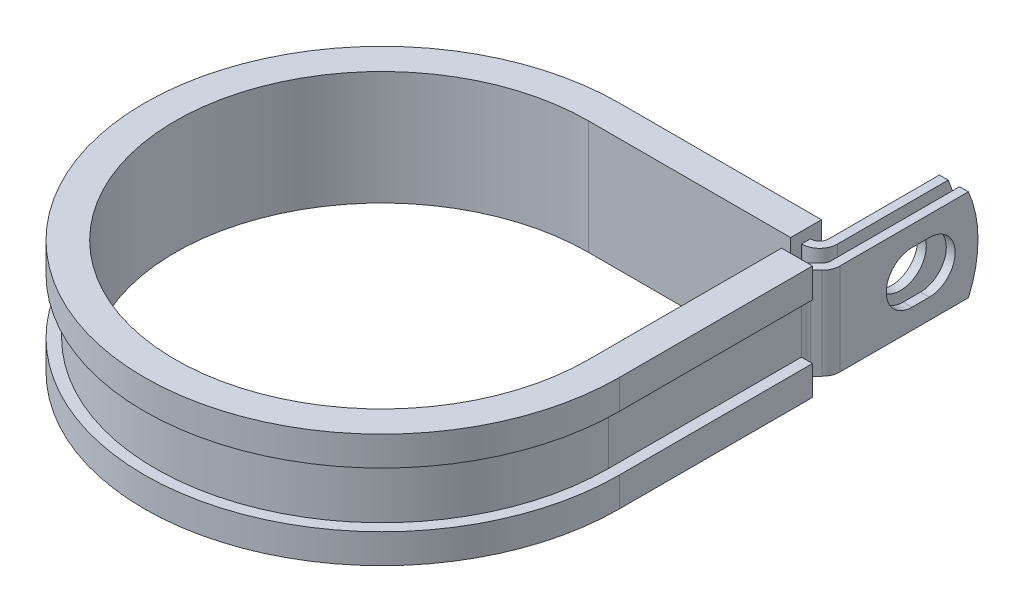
ISO-10303-21;
HEADER;
FILE_DESCRIPTION(('STEP AP214'),'2;1');
FILE_NAME('part.step','',(''),(''),'','','');
FILE_SCHEMA(('AUTOMOTIVE_DESIGN { 1 0 10303 214 1 1 1 1 }'));
ENDSEC;
DATA;
#1=APPLICATION_CONTEXT('core data for automotive mechanical design processes');
#2=APPLICATION_PROTOCOL_DEFINITION('international standard','automotive_design',2000,#1);
#3=PRODUCT_CONTEXT('',#1,'mechanical');
#4=PRODUCT('Part','Part','',(#3));
#5=PRODUCT_RELATED_PRODUCT_CATEGORY('part','',(#4));
#6=PRODUCT_DEFINITION_FORMATION('','',#4);
#7=PRODUCT_DEFINITION_CONTEXT('part definition',#1,'design');
#8=PRODUCT_DEFINITION('design','',#6,#7);
#9=PRODUCT_DEFINITION_SHAPE('','',#8);
#10=(LENGTH_UNIT() NAMED_UNIT(*) SI_UNIT(.MILLI.,.METRE.));
#11=(NAMED_UNIT(*) PLANE_ANGLE_UNIT() SI_UNIT($,.RADIAN.));
#12=(NAMED_UNIT(*) SI_UNIT($,.STERADIAN.) SOLID_ANGLE_UNIT());
#13=UNCERTAINTY_MEASURE_WITH_UNIT(LENGTH_MEASURE(1.E-05),#10,'distance_accuracy_value','');
#14=(GEOMETRIC_REPRESENTATION_CONTEXT(3) GLOBAL_UNCERTAINTY_ASSIGNED_CONTEXT((#13)) GLOBAL_UNIT_ASSIGNED_CONTEXT((#10,
#11,#12)) REPRESENTATION_CONTEXT('',''));
#15=CARTESIAN_POINT('',(0.,0.,0.));
#16=DIRECTION('',(0.,0.,1.));
#17=DIRECTION('',(1.,0.,0.));
#18=AXIS2_PLACEMENT_3D('',#15,#16,#17);
#19=CARTESIAN_POINT('',(30.7772698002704,-6.35,-30.099));
#20=DIRECTION('',(0.,1.,0.));
#21=DIRECTION('',(1.,0.,0.));
#22=AXIS2_PLACEMENT_3D('',#19,#20,#21);
#23=PLANE('',#22);
#24=DIRECTION('',(0.,0.,-1.));
#25=VECTOR('',#24,1.);
#26=CARTESIAN_POINT('',(27.9324698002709,-6.35,-30.099));
#27=LINE('',#26,#25);
#28=CARTESIAN_POINT('',(27.9324698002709,-6.35,-30.099));
#29=VERTEX_POINT('',#28);
#30=CARTESIAN_POINT('',(27.9324698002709,-6.35,-31.3182));
#31=VERTEX_POINT('',#30);
#32=EDGE_CURVE('E505',#29,#31,#27,.T.);
#33=ORIENTED_EDGE('',*,*,#32,.T.);
#34=DIRECTION('',(1.,0.,0.));
#35=VECTOR('',#34,1.);
#36=CARTESIAN_POINT('',(0.,-6.35,-31.3182));
#37=LINE('',#36,#35);
#38=CARTESIAN_POINT('',(27.9832698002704,-6.35,-31.3182));
#39=VERTEX_POINT('',#38);
#40=EDGE_CURVE('E392',#39,#31,#37,.F.);
#41=ORIENTED_EDGE('',*,*,#40,.F.);
#42=CARTESIAN_POINT('',(27.9832698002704,-6.35,-32.5374));
#43=DIRECTION('',(0.,1.,0.));
#44=DIRECTION('',(1.,0.,0.));
#45=AXIS2_PLACEMENT_3D('',#42,#43,#44);
#46=CIRCLE('',#45,1.2192);
#47=CARTESIAN_POINT('',(29.2024698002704,-6.35,-32.5374));
#48=VERTEX_POINT('',#47);
#49=EDGE_CURVE('E390',#48,#39,#46,.F.);
#50=ORIENTED_EDGE('',*,*,#49,.F.);
#51=DIRECTION('',(0.,0.,1.));
#52=VECTOR('',#51,1.);
#53=CARTESIAN_POINT('',(29.2024698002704,-6.35,-49.1998));
#54=LINE('',#53,#52);
#55=CARTESIAN_POINT('',(29.2024698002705,-6.35,-47.8744778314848));
#56=VERTEX_POINT('',#55);
#57=EDGE_CURVE('E388',#56,#48,#54,.T.);
#58=ORIENTED_EDGE('',*,*,#57,.F.);
#59=DIRECTION('',(-1.,0.,0.));
#60=VECTOR('',#59,1.);
#61=CARTESIAN_POINT('',(33.2156698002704,-6.35,-47.8744778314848));
#62=LINE('',#61,#60);
#63=CARTESIAN_POINT('',(30.4216698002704,-6.35,-47.8744778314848));
#64=VERTEX_POINT('',#63);
#65=EDGE_CURVE('E11',#64,#56,#62,.T.);
#66=ORIENTED_EDGE('',*,*,#65,.F.);
#67=DIRECTION('',(0.,0.,1.));
#68=VECTOR('',#67,1.);
#69=CARTESIAN_POINT('',(30.4216698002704,-6.35,-49.1998));
#70=LINE('',#69,#68);
#71=CARTESIAN_POINT('',(30.4216698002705,-6.35,-32.5374));
#72=VERTEX_POINT('',#71);
#73=EDGE_CURVE('E386',#64,#72,#70,.T.);
#74=ORIENTED_EDGE('',*,*,#73,.T.);
#75=CARTESIAN_POINT('',(27.9832698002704,-6.35,-32.5374));
#76=DIRECTION('',(0.,-1.,0.));
#77=DIRECTION('',(0.,0.,1.));
#78=AXIS2_PLACEMENT_3D('',#75,#76,#77);
#79=CIRCLE('',#78,2.4384);
#80=CARTESIAN_POINT('',(27.9832698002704,-6.35,-30.099));
#81=VERTEX_POINT('',#80);
#82=EDGE_CURVE('E383',#72,#81,#79,.T.);
#83=ORIENTED_EDGE('',*,*,#82,.T.);
#84=DIRECTION('',(-1.,0.,0.));
#85=VECTOR('',#84,1.);
#86=CARTESIAN_POINT('',(0.,-6.35,-30.099));
#87=LINE('',#86,#85);
#88=EDGE_CURVE('E380',#81,#29,#87,.T.);
#89=ORIENTED_EDGE('',*,*,#88,.T.);
#90=EDGE_LOOP('',(#33,#41,#50,#58,#66,#74,#83,#89));
#91=FACE_BOUND('',#90,.T.);
#92=ADVANCED_FACE('F36',(#91),#23,.F.);
#93=CARTESIAN_POINT('',(30.7772698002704,6.35,-30.099));
#94=DIRECTION('',(0.,1.,0.));
#95=DIRECTION('',(1.,0.,0.));
#96=AXIS2_PLACEMENT_3D('',#93,#94,#95);
#97=PLANE('',#96);
#98=DIRECTION('',(1.,0.,0.));
#99=VECTOR('',#98,1.);
#100=CARTESIAN_POINT('',(0.,6.35,-31.3182));
#101=LINE('',#100,#99);
#102=CARTESIAN_POINT('',(27.9832698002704,6.35,-31.3182));
#103=VERTEX_POINT('',#102);
#104=CARTESIAN_POINT('',(27.9324698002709,6.35,-31.3182));
#105=VERTEX_POINT('',#104);
#106=EDGE_CURVE('E350',#103,#105,#101,.F.);
#107=ORIENTED_EDGE('',*,*,#106,.T.);
#108=DIRECTION('',(0.,0.,1.));
#109=VECTOR('',#108,1.);
#110=CARTESIAN_POINT('',(27.9324698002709,6.35,-31.3182));
#111=LINE('',#110,#109);
#112=CARTESIAN_POINT('',(27.9324698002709,6.35,-30.099));
#113=VERTEX_POINT('',#112);
#114=EDGE_CURVE('E499',#105,#113,#111,.T.);
#115=ORIENTED_EDGE('',*,*,#114,.T.);
#116=DIRECTION('',(-1.,0.,0.));
#117=VECTOR('',#116,1.);
#118=CARTESIAN_POINT('',(0.,6.35,-30.099));
#119=LINE('',#118,#117);
#120=CARTESIAN_POINT('',(27.9832698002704,6.35,-30.099));
#121=VERTEX_POINT('',#120);
#122=EDGE_CURVE('E607',#121,#113,#119,.T.);
#123=ORIENTED_EDGE('',*,*,#122,.F.);
#124=CARTESIAN_POINT('',(27.9832698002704,6.35,-32.5374));
#125=DIRECTION('',(0.,-1.,0.));
#126=DIRECTION('',(0.,0.,1.));
#127=AXIS2_PLACEMENT_3D('',#124,#125,#126);
#128=CIRCLE('',#127,2.4384);
#129=CARTESIAN_POINT('',(30.4216698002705,6.35,-32.5374));
#130=VERTEX_POINT('',#129);
#131=EDGE_CURVE('E352',#130,#121,#128,.T.);
#132=ORIENTED_EDGE('',*,*,#131,.F.);
#133=DIRECTION('',(0.,0.,1.));
#134=VECTOR('',#133,1.);
#135=CARTESIAN_POINT('',(30.4216698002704,6.35,-49.1998));
#136=LINE('',#135,#134);
#137=CARTESIAN_POINT('',(30.4216698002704,6.35,-47.8744778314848));
#138=VERTEX_POINT('',#137);
#139=EDGE_CURVE('E343',#138,#130,#136,.T.);
#140=ORIENTED_EDGE('',*,*,#139,.F.);
#141=DIRECTION('',(-1.,0.,0.));
#142=VECTOR('',#141,1.);
#143=CARTESIAN_POINT('',(33.2156698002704,6.35,-47.8744778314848));
#144=LINE('',#143,#142);
#145=CARTESIAN_POINT('',(29.2024698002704,6.35,-47.8744778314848));
#146=VERTEX_POINT('',#145);
#147=EDGE_CURVE('E44',#138,#146,#144,.T.);
#148=ORIENTED_EDGE('',*,*,#147,.T.);
#149=DIRECTION('',(0.,0.,1.));
#150=VECTOR('',#149,1.);
#151=CARTESIAN_POINT('',(29.2024698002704,6.35,-49.1998));
#152=LINE('',#151,#150);
#153=CARTESIAN_POINT('',(29.2024698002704,6.35,-32.5374));
#154=VERTEX_POINT('',#153);
#155=EDGE_CURVE('E340',#146,#154,#152,.T.);
#156=ORIENTED_EDGE('',*,*,#155,.T.);
#157=CARTESIAN_POINT('',(27.9832698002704,6.35,-32.5374));
#158=DIRECTION('',(0.,1.,0.));
#159=DIRECTION('',(1.,0.,0.));
#160=AXIS2_PLACEMENT_3D('',#157,#158,#159);
#161=CIRCLE('',#160,1.2192);
#162=EDGE_CURVE('E348',#154,#103,#161,.F.);
#163=ORIENTED_EDGE('',*,*,#162,.T.);
#164=EDGE_LOOP('',(#107,#115,#123,#132,#140,#148,#156,#163));
#165=FACE_BOUND('',#164,.T.);
#166=ADVANCED_FACE('F339',(#165),#97,.T.);
#167=CARTESIAN_POINT('',(0.,6.35,-30.099));
#168=DIRECTION('',(0.,0.,1.));
#169=DIRECTION('',(1.,0.,0.));
#170=AXIS2_PLACEMENT_3D('',#167,#168,#169);
#171=PLANE('',#170);
#172=ORIENTED_EDGE('',*,*,#122,.T.);
#173=DIRECTION('',(0.,-1.,0.));
#174=VECTOR('',#173,1.);
#175=CARTESIAN_POINT('',(27.9324698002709,6.35,-30.099));
#176=LINE('',#175,#174);
#177=EDGE_CURVE('E502',#113,#29,#176,.T.);
#178=ORIENTED_EDGE('',*,*,#177,.T.);
#179=ORIENTED_EDGE('',*,*,#88,.F.);
#180=DIRECTION('',(0.,-1.,0.));
#181=VECTOR('',#180,1.);
#182=CARTESIAN_POINT('',(27.9832698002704,6.35,-30.099));
#183=LINE('',#182,#181);
#184=EDGE_CURVE('E326',#121,#81,#183,.T.);
#185=ORIENTED_EDGE('',*,*,#184,.F.);
#186=EDGE_LOOP('',(#172,#178,#179,#185));
#187=FACE_BOUND('',#186,.T.);
#188=ADVANCED_FACE('F617',(#187),#171,.T.);
#189=CARTESIAN_POINT('',(33.2156698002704,6.35,-30.099));
#190=DIRECTION('',(-1.,0.,0.));
#191=DIRECTION('',(0.,0.,1.));
#192=AXIS2_PLACEMENT_3D('',#189,#190,#191);
#193=PLANE('',#192);
#194=CARTESIAN_POINT('',(33.2156698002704,0.,-42.4687999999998));
#195=DIRECTION('',(1.,0.,0.));
#196=DIRECTION('',(0.,0.,-1.));
#197=AXIS2_PLACEMENT_3D('',#194,#195,#196);
#198=CIRCLE('',#197,3.5687);
#199=CARTESIAN_POINT('',(33.2156698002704,-3.5687,-42.4688000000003));
#200=VERTEX_POINT('',#199);
#201=CARTESIAN_POINT('',(33.2156698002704,3.5687,-42.4688000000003));
#202=VERTEX_POINT('',#201);
#203=EDGE_CURVE('E562',#200,#202,#198,.T.);
#204=ORIENTED_EDGE('',*,*,#203,.F.);
#205=DIRECTION('',(0.,0.,-1.));
#206=VECTOR('',#205,1.);
#207=CARTESIAN_POINT('',(33.2156698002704,-3.5687,-40.0811999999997));
#208=LINE('',#207,#206);
#209=CARTESIAN_POINT('',(33.2156698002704,-3.5687,-40.0811999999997));
#210=VERTEX_POINT('',#209);
#211=EDGE_CURVE('E565',#210,#200,#208,.T.);
#212=ORIENTED_EDGE('',*,*,#211,.F.);
#213=CARTESIAN_POINT('',(33.2156698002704,0.,-40.0811999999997));
#214=DIRECTION('',(1.,0.,0.));
#215=DIRECTION('',(0.,0.,-1.));
#216=AXIS2_PLACEMENT_3D('',#213,#214,#215);
#217=CIRCLE('',#216,3.5687);
#218=CARTESIAN_POINT('',(33.2156698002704,3.5687,-40.0811999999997));
#219=VERTEX_POINT('',#218);
#220=EDGE_CURVE('E558',#219,#210,#217,.T.);
#221=ORIENTED_EDGE('',*,*,#220,.F.);
#222=DIRECTION('',(0.,0.,1.));
#223=VECTOR('',#222,1.);
#224=CARTESIAN_POINT('',(33.2156698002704,3.5687,-40.0811999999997));
#225=LINE('',#224,#223);
#226=EDGE_CURVE('E559',#202,#219,#225,.T.);
#227=ORIENTED_EDGE('',*,*,#226,.F.);
#228=EDGE_LOOP('',(#204,#212,#221,#227));
#229=FACE_BOUND('',#228,.T.);
#230=DIRECTION('',(0.,0.,-1.));
#231=VECTOR('',#230,1.);
#232=CARTESIAN_POINT('',(33.2156698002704,-6.35,-30.099));
#233=LINE('',#232,#231);
#234=CARTESIAN_POINT('',(33.2156698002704,-6.35,-30.099));
#235=VERTEX_POINT('',#234);
#236=CARTESIAN_POINT('',(33.2156698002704,-6.35,-47.8744778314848));
#237=VERTEX_POINT('',#236);
#238=EDGE_CURVE('E364',#235,#237,#233,.T.);
#239=ORIENTED_EDGE('',*,*,#238,.T.);
#240=CARTESIAN_POINT('',(33.2156698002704,0.,-33.3248));
#241=DIRECTION('',(-1.,0.,0.));
#242=DIRECTION('',(0.,0.,1.));
#243=AXIS2_PLACEMENT_3D('',#240,#241,#242);
#244=CIRCLE('',#243,15.875);
#245=CARTESIAN_POINT('',(33.2156698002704,6.35,-47.8744778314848));
#246=VERTEX_POINT('',#245);
#247=EDGE_CURVE('E550',#246,#237,#244,.T.);
#248=ORIENTED_EDGE('',*,*,#247,.F.);
#249=DIRECTION('',(0.,0.,-1.));
#250=VECTOR('',#249,1.);
#251=CARTESIAN_POINT('',(33.2156698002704,6.35,-30.099));
#252=LINE('',#251,#250);
#253=CARTESIAN_POINT('',(33.2156698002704,6.35,-30.099));
#254=VERTEX_POINT('',#253);
#255=EDGE_CURVE('E401',#254,#246,#252,.T.);
#256=ORIENTED_EDGE('',*,*,#255,.F.);
#257=DIRECTION('',(0.,-1.,0.));
#258=VECTOR('',#257,1.);
#259=CARTESIAN_POINT('',(33.2156698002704,6.35,-30.099));
#260=LINE('',#259,#258);
#261=EDGE_CURVE('E363',#254,#235,#260,.T.);
#262=ORIENTED_EDGE('',*,*,#261,.T.);
#263=EDGE_LOOP('',(#239,#248,#256,#262));
#264=FACE_BOUND('',#263,.T.);
#265=ADVANCED_FACE('F38',(#229,#264),#193,.F.);
#266=CARTESIAN_POINT('',(31.9964698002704,6.35,-30.099));
#267=DIRECTION('',(-1.,0.,0.));
#268=DIRECTION('',(0.,0.,1.));
#269=AXIS2_PLACEMENT_3D('',#266,#267,#268);
#270=PLANE('',#269);
#271=DIRECTION('',(0.,0.,-1.));
#272=VECTOR('',#271,1.);
#273=CARTESIAN_POINT('',(31.9964698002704,-3.5687,-40.0811999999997));
#274=LINE('',#273,#272);
#275=CARTESIAN_POINT('',(31.9964698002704,-3.5687,-40.0811999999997));
#276=VERTEX_POINT('',#275);
#277=CARTESIAN_POINT('',(31.9964698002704,-3.5687,-42.4688000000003));
#278=VERTEX_POINT('',#277);
#279=EDGE_CURVE('E561',#276,#278,#274,.T.);
#280=ORIENTED_EDGE('',*,*,#279,.T.);
#281=CARTESIAN_POINT('',(31.9964698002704,0.,-42.4687999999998));
#282=DIRECTION('',(-1.,0.,0.));
#283=DIRECTION('',(0.,0.,1.));
#284=AXIS2_PLACEMENT_3D('',#281,#282,#283);
#285=CIRCLE('',#284,3.5687);
#286=CARTESIAN_POINT('',(31.9964698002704,3.5687,-42.4688000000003));
#287=VERTEX_POINT('',#286);
#288=EDGE_CURVE('E582',#278,#287,#285,.F.);
#289=ORIENTED_EDGE('',*,*,#288,.T.);
#290=DIRECTION('',(0.,0.,1.));
#291=VECTOR('',#290,1.);
#292=CARTESIAN_POINT('',(31.9964698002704,3.5687,-40.0811999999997));
#293=LINE('',#292,#291);
#294=CARTESIAN_POINT('',(31.9964698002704,3.5687,-40.0811999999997));
#295=VERTEX_POINT('',#294);
#296=EDGE_CURVE('E578',#287,#295,#293,.T.);
#297=ORIENTED_EDGE('',*,*,#296,.T.);
#298=CARTESIAN_POINT('',(31.9964698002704,0.,-40.0811999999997));
#299=DIRECTION('',(-1.,0.,0.));
#300=DIRECTION('',(0.,0.,1.));
#301=AXIS2_PLACEMENT_3D('',#298,#299,#300);
#302=CIRCLE('',#301,3.5687);
#303=EDGE_CURVE('E573',#295,#276,#302,.F.);
#304=ORIENTED_EDGE('',*,*,#303,.T.);
#305=EDGE_LOOP('',(#280,#289,#297,#304));
#306=FACE_BOUND('',#305,.T.);
#307=CARTESIAN_POINT('',(31.9964698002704,0.,-33.3248));
#308=DIRECTION('',(-1.,0.,0.));
#309=DIRECTION('',(0.,0.,1.));
#310=AXIS2_PLACEMENT_3D('',#307,#308,#309);
#311=CIRCLE('',#310,15.875);
#312=CARTESIAN_POINT('',(31.9964698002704,6.35,-47.8744778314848));
#313=VERTEX_POINT('',#312);
#314=CARTESIAN_POINT('',(31.9964698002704,-6.35,-47.8744778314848));
#315=VERTEX_POINT('',#314);
#316=EDGE_CURVE('E58',#313,#315,#311,.T.);
#317=ORIENTED_EDGE('',*,*,#316,.T.);
#318=DIRECTION('',(0.,0.,-1.));
#319=VECTOR('',#318,1.);
#320=CARTESIAN_POINT('',(31.9964698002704,-6.35,-30.099));
#321=LINE('',#320,#319);
#322=CARTESIAN_POINT('',(31.9964698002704,-6.35,-30.099));
#323=VERTEX_POINT('',#322);
#324=EDGE_CURVE('E367',#323,#315,#321,.T.);
#325=ORIENTED_EDGE('',*,*,#324,.F.);
#326=DIRECTION('',(0.,-1.,0.));
#327=VECTOR('',#326,1.);
#328=CARTESIAN_POINT('',(31.9964698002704,6.35,-30.099));
#329=LINE('',#328,#327);
#330=CARTESIAN_POINT('',(31.9964698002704,6.35,-30.099));
#331=VERTEX_POINT('',#330);
#332=EDGE_CURVE('E334',#331,#323,#329,.T.);
#333=ORIENTED_EDGE('',*,*,#332,.F.);
#334=DIRECTION('',(0.,0.,-1.));
#335=VECTOR('',#334,1.);
#336=CARTESIAN_POINT('',(31.9964698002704,6.35,-30.099));
#337=LINE('',#336,#335);
#338=EDGE_CURVE('E597',#331,#313,#337,.T.);
#339=ORIENTED_EDGE('',*,*,#338,.T.);
#340=EDGE_LOOP('',(#317,#325,#333,#339));
#341=FACE_BOUND('',#340,.T.);
#342=ADVANCED_FACE('F671',(#306,#341),#270,.T.);
#343=CARTESIAN_POINT('',(30.4216698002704,6.35,-49.1998));
#344=DIRECTION('',(1.,0.,0.));
#345=DIRECTION('',(0.,0.,-1.));
#346=AXIS2_PLACEMENT_3D('',#343,#344,#345);
#347=PLANE('',#346);
#348=CARTESIAN_POINT('',(30.4216698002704,0.,-41.275));
#349=DIRECTION('',(1.,0.,0.));
#350=DIRECTION('',(0.,0.,-1.));
#351=AXIS2_PLACEMENT_3D('',#348,#349,#350);
#352=CIRCLE('',#351,3.5687);
#353=CARTESIAN_POINT('',(30.4216698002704,0.,-44.8437));
#354=VERTEX_POINT('',#353);
#355=EDGE_CURVE('E368',#354,#354,#352,.F.);
#356=ORIENTED_EDGE('',*,*,#355,.T.);
#357=EDGE_LOOP('',(#356));
#358=FACE_BOUND('',#357,.T.);
#359=ORIENTED_EDGE('',*,*,#73,.F.);
#360=CARTESIAN_POINT('',(30.4216698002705,0.,-33.3248));
#361=DIRECTION('',(1.,0.,0.));
#362=DIRECTION('',(0.,0.,-1.));
#363=AXIS2_PLACEMENT_3D('',#360,#361,#362);
#364=CIRCLE('',#363,15.875);
#365=EDGE_CURVE('E555',#64,#138,#364,.T.);
#366=ORIENTED_EDGE('',*,*,#365,.T.);
#367=ORIENTED_EDGE('',*,*,#139,.T.);
#368=DIRECTION('',(0.,-1.,0.));
#369=VECTOR('',#368,1.);
#370=CARTESIAN_POINT('',(30.4216698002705,6.35,-32.5374));
#371=LINE('',#370,#369);
#372=EDGE_CURVE('E323',#130,#72,#371,.T.);
#373=ORIENTED_EDGE('',*,*,#372,.T.);
#374=EDGE_LOOP('',(#359,#366,#367,#373));
#375=FACE_BOUND('',#374,.T.);
#376=ADVANCED_FACE('F623',(#358,#375),#347,.T.);
#377=CARTESIAN_POINT('',(29.2024698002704,6.35,-49.1998));
#378=DIRECTION('',(1.,0.,0.));
#379=DIRECTION('',(0.,0.,-1.));
#380=AXIS2_PLACEMENT_3D('',#377,#378,#379);
#381=PLANE('',#380);
#382=CARTESIAN_POINT('',(29.2024698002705,0.,-41.275));
#383=DIRECTION('',(-1.,0.,0.));
#384=DIRECTION('',(0.,0.,1.));
#385=AXIS2_PLACEMENT_3D('',#382,#383,#384);
#386=CIRCLE('',#385,3.5687);
#387=CARTESIAN_POINT('',(29.2024698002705,0.,-37.7063));
#388=VERTEX_POINT('',#387);
#389=EDGE_CURVE('E590',#388,#388,#386,.T.);
#390=ORIENTED_EDGE('',*,*,#389,.F.);
#391=EDGE_LOOP('',(#390));
#392=FACE_BOUND('',#391,.T.);
#393=CARTESIAN_POINT('',(29.2024698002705,0.,-33.3248));
#394=DIRECTION('',(-1.,0.,0.));
#395=DIRECTION('',(0.,0.,1.));
#396=AXIS2_PLACEMENT_3D('',#393,#394,#395);
#397=CIRCLE('',#396,15.875);
#398=EDGE_CURVE('E50',#146,#56,#397,.T.);
#399=ORIENTED_EDGE('',*,*,#398,.T.);
#400=ORIENTED_EDGE('',*,*,#57,.T.);
#401=DIRECTION('',(0.,-1.,0.));
#402=VECTOR('',#401,1.);
#403=CARTESIAN_POINT('',(29.2024698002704,6.35,-32.5374));
#404=LINE('',#403,#402);
#405=EDGE_CURVE('E320',#154,#48,#404,.T.);
#406=ORIENTED_EDGE('',*,*,#405,.F.);
#407=ORIENTED_EDGE('',*,*,#155,.F.);
#408=EDGE_LOOP('',(#399,#400,#406,#407));
#409=FACE_BOUND('',#408,.T.);
#410=ADVANCED_FACE('F346',(#392,#409),#381,.F.);
#411=CARTESIAN_POINT('',(32.5374,-6.35,-26.6865026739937));
#412=DIRECTION('',(0.,1.,0.));
#413=DIRECTION('',(1.,0.,0.));
#414=AXIS2_PLACEMENT_3D('',#411,#412,#413);
#415=CIRCLE('',#414,1.21920000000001);
#416=CARTESIAN_POINT('',(31.3182,-6.35,-26.6865026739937));
#417=VERTEX_POINT('',#416);
#418=CARTESIAN_POINT('',(31.6752954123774,-6.35,-27.5486072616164));
#419=VERTEX_POINT('',#418);
#420=EDGE_CURVE('E395',#417,#419,#415,.F.);
#421=ORIENTED_EDGE('',*,*,#420,.F.);
#422=DIRECTION('',(1.,0.,0.));
#423=VECTOR('',#422,1.);
#424=CARTESIAN_POINT('',(30.099,-6.35,-26.6865026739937));
#425=LINE('',#424,#423);
#426=CARTESIAN_POINT('',(30.099,-6.35,-26.6865026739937));
#427=VERTEX_POINT('',#426);
#428=EDGE_CURVE('E433',#427,#417,#425,.T.);
#429=ORIENTED_EDGE('',*,*,#428,.F.);
#430=CARTESIAN_POINT('',(32.5374,-6.35,-26.6865026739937));
#431=DIRECTION('',(0.,-1.,0.));
#432=DIRECTION('',(0.,0.,1.));
#433=AXIS2_PLACEMENT_3D('',#430,#431,#432);
#434=CIRCLE('',#433,2.43840000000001);
#435=CARTESIAN_POINT('',(30.8131908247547,-6.35,-28.410711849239));
#436=VERTEX_POINT('',#435);
#437=EDGE_CURVE('E377',#427,#436,#434,.T.);
#438=ORIENTED_EDGE('',*,*,#437,.T.);
#439=DIRECTION('',(0.707106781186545,0.,-0.70710678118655));
#440=VECTOR('',#439,1.);
#441=CARTESIAN_POINT('',(30.8131908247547,-6.35,-28.410711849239));
#442=LINE('',#441,#440);
#443=CARTESIAN_POINT('',(31.6393743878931,-6.35,-29.2368954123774));
#444=VERTEX_POINT('',#443);
#445=EDGE_CURVE('E374',#436,#444,#442,.T.);
#446=ORIENTED_EDGE('',*,*,#445,.T.);
#447=CARTESIAN_POINT('',(30.7772698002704,-6.35,-30.099));
#448=DIRECTION('',(0.,1.,0.));
#449=DIRECTION('',(0.,0.,1.));
#450=AXIS2_PLACEMENT_3D('',#447,#448,#449);
#451=CIRCLE('',#450,1.2192);
#452=EDGE_CURVE('E371',#444,#323,#451,.T.);
#453=ORIENTED_EDGE('',*,*,#452,.T.);
#454=ORIENTED_EDGE('',*,*,#324,.T.);
#455=DIRECTION('',(-1.,0.,0.));
#456=VECTOR('',#455,1.);
#457=CARTESIAN_POINT('',(33.2156698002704,-6.35,-47.8744778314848));
#458=LINE('',#457,#456);
#459=EDGE_CURVE('E548',#237,#315,#458,.T.);
#460=ORIENTED_EDGE('',*,*,#459,.F.);
#461=ORIENTED_EDGE('',*,*,#238,.F.);
#462=CARTESIAN_POINT('',(30.7772698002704,-6.35,-30.099));
#463=DIRECTION('',(0.,1.,0.));
#464=DIRECTION('',(1.,0.,0.));
#465=AXIS2_PLACEMENT_3D('',#462,#463,#464);
#466=CIRCLE('',#465,2.4384);
#467=CARTESIAN_POINT('',(32.5014789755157,-6.35,-28.3747908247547));
#468=VERTEX_POINT('',#467);
#469=EDGE_CURVE('E399',#468,#235,#466,.T.);
#470=ORIENTED_EDGE('',*,*,#469,.F.);
#471=DIRECTION('',(0.707106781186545,0.,-0.70710678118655));
#472=VECTOR('',#471,1.);
#473=CARTESIAN_POINT('',(31.6752954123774,-6.35,-27.5486072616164));
#474=LINE('',#473,#472);
#475=EDGE_CURVE('E397',#419,#468,#474,.T.);
#476=ORIENTED_EDGE('',*,*,#475,.F.);
#477=EDGE_LOOP('',(#421,#429,#438,#446,#453,#454,#460,#461,#470,#476));
#478=FACE_BOUND('',#477,.T.);
#479=ADVANCED_FACE('F657',(#478),#23,.F.);
#480=DIRECTION('',(-1.,0.,0.));
#481=VECTOR('',#480,1.);
#482=CARTESIAN_POINT('',(31.3182,6.35,-26.6865026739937));
#483=LINE('',#482,#481);
#484=CARTESIAN_POINT('',(31.3182,6.35,-26.6865026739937));
#485=VERTEX_POINT('',#484);
#486=CARTESIAN_POINT('',(30.099,6.35,-26.6865026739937));
#487=VERTEX_POINT('',#486);
#488=EDGE_CURVE('E422',#485,#487,#483,.T.);
#489=ORIENTED_EDGE('',*,*,#488,.F.);
#490=CARTESIAN_POINT('',(32.5374,6.35,-26.6865026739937));
#491=DIRECTION('',(0.,1.,0.));
#492=DIRECTION('',(1.,0.,0.));
#493=AXIS2_PLACEMENT_3D('',#490,#491,#492);
#494=CIRCLE('',#493,1.21920000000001);
#495=CARTESIAN_POINT('',(31.6752954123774,6.35,-27.5486072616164));
#496=VERTEX_POINT('',#495);
#497=EDGE_CURVE('E357',#485,#496,#494,.F.);
#498=ORIENTED_EDGE('',*,*,#497,.T.);
#499=DIRECTION('',(0.707106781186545,0.,-0.70710678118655));
#500=VECTOR('',#499,1.);
#501=CARTESIAN_POINT('',(31.6752954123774,6.35,-27.5486072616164));
#502=LINE('',#501,#500);
#503=CARTESIAN_POINT('',(32.5014789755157,6.35,-28.3747908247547));
#504=VERTEX_POINT('',#503);
#505=EDGE_CURVE('E359',#496,#504,#502,.T.);
#506=ORIENTED_EDGE('',*,*,#505,.T.);
#507=CARTESIAN_POINT('',(30.7772698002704,6.35,-30.099));
#508=DIRECTION('',(0.,1.,0.));
#509=DIRECTION('',(1.,0.,0.));
#510=AXIS2_PLACEMENT_3D('',#507,#508,#509);
#511=CIRCLE('',#510,2.4384);
#512=EDGE_CURVE('E361',#504,#254,#511,.T.);
#513=ORIENTED_EDGE('',*,*,#512,.T.);
#514=ORIENTED_EDGE('',*,*,#255,.T.);
#515=DIRECTION('',(-1.,0.,0.));
#516=VECTOR('',#515,1.);
#517=CARTESIAN_POINT('',(33.2156698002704,6.35,-47.8744778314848));
#518=LINE('',#517,#516);
#519=EDGE_CURVE('E552',#246,#313,#518,.T.);
#520=ORIENTED_EDGE('',*,*,#519,.T.);
#521=ORIENTED_EDGE('',*,*,#338,.F.);
#522=CARTESIAN_POINT('',(30.7772698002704,6.35,-30.099));
#523=DIRECTION('',(0.,1.,0.));
#524=DIRECTION('',(0.,0.,1.));
#525=AXIS2_PLACEMENT_3D('',#522,#523,#524);
#526=CIRCLE('',#525,1.2192);
#527=CARTESIAN_POINT('',(31.6393743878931,6.35,-29.2368954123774));
#528=VERTEX_POINT('',#527);
#529=EDGE_CURVE('E600',#528,#331,#526,.T.);
#530=ORIENTED_EDGE('',*,*,#529,.F.);
#531=DIRECTION('',(0.707106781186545,0.,-0.70710678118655));
#532=VECTOR('',#531,1.);
#533=CARTESIAN_POINT('',(30.8131908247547,6.35,-28.410711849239));
#534=LINE('',#533,#532);
#535=CARTESIAN_POINT('',(30.8131908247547,6.35,-28.410711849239));
#536=VERTEX_POINT('',#535);
#537=EDGE_CURVE('E603',#536,#528,#534,.T.);
#538=ORIENTED_EDGE('',*,*,#537,.F.);
#539=CARTESIAN_POINT('',(32.5374,6.35,-26.6865026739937));
#540=DIRECTION('',(0.,-1.,0.));
#541=DIRECTION('',(0.,0.,1.));
#542=AXIS2_PLACEMENT_3D('',#539,#540,#541);
#543=CIRCLE('',#542,2.43840000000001);
#544=EDGE_CURVE('E432',#487,#536,#543,.T.);
#545=ORIENTED_EDGE('',*,*,#544,.F.);
#546=EDGE_LOOP('',(#489,#498,#506,#513,#514,#520,#521,#530,#538,#545));
#547=FACE_BOUND('',#546,.T.);
#548=ADVANCED_FACE('F429',(#547),#97,.T.);
#549=CARTESIAN_POINT('',(30.7772698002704,6.35,-30.099));
#550=DIRECTION('',(0.,-1.,0.));
#551=DIRECTION('',(0.,0.,-1.));
#552=AXIS2_PLACEMENT_3D('',#549,#550,#551);
#553=CYLINDRICAL_SURFACE('',#552,1.2192);
#554=ORIENTED_EDGE('',*,*,#452,.F.);
#555=DIRECTION('',(0.,-1.,0.));
#556=VECTOR('',#555,1.);
#557=CARTESIAN_POINT('',(31.6393743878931,6.35,-29.2368954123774));
#558=LINE('',#557,#556);
#559=EDGE_CURVE('E332',#528,#444,#558,.T.);
#560=ORIENTED_EDGE('',*,*,#559,.F.);
#561=ORIENTED_EDGE('',*,*,#529,.T.);
#562=ORIENTED_EDGE('',*,*,#332,.T.);
#563=EDGE_LOOP('',(#554,#560,#561,#562));
#564=FACE_BOUND('',#563,.T.);
#565=ADVANCED_FACE('F667',(#564),#553,.F.);
#566=CARTESIAN_POINT('',(30.8131908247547,6.35,-28.410711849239));
#567=DIRECTION('',(-0.70710678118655,0.,-0.707106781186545));
#568=DIRECTION('',(-0.707106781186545,0.,0.70710678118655));
#569=AXIS2_PLACEMENT_3D('',#566,#567,#568);
#570=PLANE('',#569);
#571=ORIENTED_EDGE('',*,*,#445,.F.);
#572=DIRECTION('',(0.,-1.,0.));
#573=VECTOR('',#572,1.);
#574=CARTESIAN_POINT('',(30.8131908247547,6.35,-28.410711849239));
#575=LINE('',#574,#573);
#576=EDGE_CURVE('E330',#536,#436,#575,.T.);
#577=ORIENTED_EDGE('',*,*,#576,.F.);
#578=ORIENTED_EDGE('',*,*,#537,.T.);
#579=ORIENTED_EDGE('',*,*,#559,.T.);
#580=EDGE_LOOP('',(#571,#577,#578,#579));
#581=FACE_BOUND('',#580,.T.);
#582=ADVANCED_FACE('F662',(#581),#570,.T.);
#583=CARTESIAN_POINT('',(32.5374,6.35,-26.6865026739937));
#584=DIRECTION('',(0.,-1.,0.));
#585=DIRECTION('',(0.,0.,-1.));
#586=AXIS2_PLACEMENT_3D('',#583,#584,#585);
#587=CYLINDRICAL_SURFACE('',#586,2.43840000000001);
#588=ORIENTED_EDGE('',*,*,#437,.F.);
#589=DIRECTION('',(0.,-1.,0.));
#590=VECTOR('',#589,1.);
#591=CARTESIAN_POINT('',(30.099,6.35,-26.6865026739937));
#592=LINE('',#591,#590);
#593=EDGE_CURVE('E328',#487,#427,#592,.T.);
#594=ORIENTED_EDGE('',*,*,#593,.F.);
#595=ORIENTED_EDGE('',*,*,#544,.T.);
#596=ORIENTED_EDGE('',*,*,#576,.T.);
#597=EDGE_LOOP('',(#588,#594,#595,#596));
#598=FACE_BOUND('',#597,.T.);
#599=ADVANCED_FACE('F659',(#598),#587,.T.);
#600=CARTESIAN_POINT('',(27.9832698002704,6.35,-32.5374));
#601=DIRECTION('',(0.,-1.,0.));
#602=DIRECTION('',(0.,0.,-1.));
#603=AXIS2_PLACEMENT_3D('',#600,#601,#602);
#604=CYLINDRICAL_SURFACE('',#603,2.4384);
#605=ORIENTED_EDGE('',*,*,#82,.F.);
#606=ORIENTED_EDGE('',*,*,#372,.F.);
#607=ORIENTED_EDGE('',*,*,#131,.T.);
#608=ORIENTED_EDGE('',*,*,#184,.T.);
#609=EDGE_LOOP('',(#605,#606,#607,#608));
#610=FACE_BOUND('',#609,.T.);
#611=ADVANCED_FACE('F613',(#610),#604,.T.);
#612=CARTESIAN_POINT('',(27.9832698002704,6.35,-32.5374));
#613=DIRECTION('',(0.,-1.,0.));
#614=DIRECTION('',(0.,0.,-1.));
#615=AXIS2_PLACEMENT_3D('',#612,#613,#614);
#616=CYLINDRICAL_SURFACE('',#615,1.2192);
#617=ORIENTED_EDGE('',*,*,#49,.T.);
#618=DIRECTION('',(0.,-1.,0.));
#619=VECTOR('',#618,1.);
#620=CARTESIAN_POINT('',(27.9832698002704,6.35,-31.3182));
#621=LINE('',#620,#619);
#622=EDGE_CURVE('E311',#103,#39,#621,.T.);
#623=ORIENTED_EDGE('',*,*,#622,.F.);
#624=ORIENTED_EDGE('',*,*,#162,.F.);
#625=ORIENTED_EDGE('',*,*,#405,.T.);
#626=EDGE_LOOP('',(#617,#623,#624,#625));
#627=FACE_BOUND('',#626,.T.);
#628=ADVANCED_FACE('F628',(#627),#616,.F.);
#629=CARTESIAN_POINT('',(0.,6.35,-31.3182));
#630=DIRECTION('',(0.,0.,1.));
#631=DIRECTION('',(1.,0.,0.));
#632=AXIS2_PLACEMENT_3D('',#629,#630,#631);
#633=PLANE('',#632);
#634=DIRECTION('',(0.,-1.,0.));
#635=VECTOR('',#634,1.);
#636=CARTESIAN_POINT('',(0.,6.35,-31.3182));
#637=LINE('',#636,#635);
#638=CARTESIAN_POINT('',(4.39305330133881E-13,3.81,-31.3182));
#639=VERTEX_POINT('',#638);
#640=CARTESIAN_POINT('',(4.39305330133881E-13,-3.81,-31.3182));
#641=VERTEX_POINT('',#640);
#642=EDGE_CURVE('E302',#639,#641,#637,.T.);
#643=ORIENTED_EDGE('',*,*,#642,.F.);
#644=DIRECTION('',(1.,0.,0.));
#645=VECTOR('',#644,1.);
#646=CARTESIAN_POINT('',(4.39305330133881E-13,3.81,-31.3182));
#647=LINE('',#646,#645);
#648=CARTESIAN_POINT('',(27.9324698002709,3.81,-31.3182));
#649=VERTEX_POINT('',#648);
#650=EDGE_CURVE('E545',#639,#649,#647,.T.);
#651=ORIENTED_EDGE('',*,*,#650,.T.);
#652=DIRECTION('',(0.,1.,0.));
#653=VECTOR('',#652,1.);
#654=CARTESIAN_POINT('',(27.9324698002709,6.35,-31.3182));
#655=LINE('',#654,#653);
#656=EDGE_CURVE('E496',#649,#105,#655,.T.);
#657=ORIENTED_EDGE('',*,*,#656,.T.);
#658=ORIENTED_EDGE('',*,*,#106,.F.);
#659=ORIENTED_EDGE('',*,*,#622,.T.);
#660=ORIENTED_EDGE('',*,*,#40,.T.);
#661=DIRECTION('',(0.,1.,0.));
#662=VECTOR('',#661,1.);
#663=CARTESIAN_POINT('',(27.9324698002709,-6.35,-31.3182));
#664=LINE('',#663,#662);
#665=CARTESIAN_POINT('',(27.9324698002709,-3.81,-31.3182));
#666=VERTEX_POINT('',#665);
#667=EDGE_CURVE('E508',#31,#666,#664,.T.);
#668=ORIENTED_EDGE('',*,*,#667,.T.);
#669=DIRECTION('',(1.,0.,0.));
#670=VECTOR('',#669,1.);
#671=CARTESIAN_POINT('',(4.39305330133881E-13,-3.81,-31.3182));
#672=LINE('',#671,#670);
#673=EDGE_CURVE('E525',#641,#666,#672,.T.);
#674=ORIENTED_EDGE('',*,*,#673,.F.);
#675=EDGE_LOOP('',(#643,#651,#657,#658,#659,#660,#668,#674));
#676=FACE_BOUND('',#675,.T.);
#677=ADVANCED_FACE('F632',(#676),#633,.F.);
#678=CARTESIAN_POINT('',(0.,6.35,0.));
#679=DIRECTION('',(0.,-1.,0.));
#680=DIRECTION('',(0.,0.,-1.));
#681=AXIS2_PLACEMENT_3D('',#678,#679,#680);
#682=CYLINDRICAL_SURFACE('',#681,31.3182);
#683=DIRECTION('',(0.,-1.,0.));
#684=VECTOR('',#683,1.);
#685=CARTESIAN_POINT('',(31.3182,6.35,0.));
#686=LINE('',#685,#684);
#687=CARTESIAN_POINT('',(31.3182,3.81,0.));
#688=VERTEX_POINT('',#687);
#689=CARTESIAN_POINT('',(31.3182,-3.81,0.));
#690=VERTEX_POINT('',#689);
#691=EDGE_CURVE('E300',#688,#690,#686,.T.);
#692=ORIENTED_EDGE('',*,*,#691,.F.);
#693=CARTESIAN_POINT('',(0.,3.81,0.));
#694=DIRECTION('',(0.,-1.,0.));
#695=DIRECTION('',(0.,0.,-1.));
#696=AXIS2_PLACEMENT_3D('',#693,#694,#695);
#697=CIRCLE('',#696,31.3182);
#698=EDGE_CURVE('E494',#688,#639,#697,.T.);
#699=ORIENTED_EDGE('',*,*,#698,.T.);
#700=ORIENTED_EDGE('',*,*,#642,.T.);
#701=CARTESIAN_POINT('',(0.,-3.81,0.));
#702=DIRECTION('',(0.,-1.,0.));
#703=DIRECTION('',(0.,0.,-1.));
#704=AXIS2_PLACEMENT_3D('',#701,#702,#703);
#705=CIRCLE('',#704,31.3182);
#706=EDGE_CURVE('E283',#690,#641,#705,.T.);
#707=ORIENTED_EDGE('',*,*,#706,.F.);
#708=EDGE_LOOP('',(#692,#699,#700,#707));
#709=FACE_BOUND('',#708,.T.);
#710=ADVANCED_FACE('F298',(#709),#682,.T.);
#711=CARTESIAN_POINT('',(31.3182,6.35,0.));
#712=DIRECTION('',(-1.,0.,0.));
#713=DIRECTION('',(0.,0.,1.));
#714=AXIS2_PLACEMENT_3D('',#711,#712,#713);
#715=PLANE('',#714);
#716=DIRECTION('',(0.,-1.,0.));
#717=VECTOR('',#716,1.);
#718=CARTESIAN_POINT('',(31.3182,6.35,-26.6865026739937));
#719=LINE('',#718,#717);
#720=CARTESIAN_POINT('',(31.3182,3.81,-26.6865026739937));
#721=VERTEX_POINT('',#720);
#722=CARTESIAN_POINT('',(31.3182,-3.81,-26.6865026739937));
#723=VERTEX_POINT('',#722);
#724=EDGE_CURVE('E314',#721,#723,#719,.T.);
#725=ORIENTED_EDGE('',*,*,#724,.F.);
#726=DIRECTION('',(0.,0.,-1.));
#727=VECTOR('',#726,1.);
#728=CARTESIAN_POINT('',(31.3182,3.81,0.));
#729=LINE('',#728,#727);
#730=EDGE_CURVE('E308',#688,#721,#729,.T.);
#731=ORIENTED_EDGE('',*,*,#730,.F.);
#732=ORIENTED_EDGE('',*,*,#691,.T.);
#733=DIRECTION('',(0.,0.,-1.));
#734=VECTOR('',#733,1.);
#735=CARTESIAN_POINT('',(31.3182,-3.81,0.));
#736=LINE('',#735,#734);
#737=EDGE_CURVE('E279',#690,#723,#736,.T.);
#738=ORIENTED_EDGE('',*,*,#737,.T.);
#739=EDGE_LOOP('',(#725,#731,#732,#738));
#740=FACE_BOUND('',#739,.T.);
#741=ADVANCED_FACE('F307',(#740),#715,.F.);
#742=CARTESIAN_POINT('',(32.5374,6.35,-26.6865026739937));
#743=DIRECTION('',(0.,-1.,0.));
#744=DIRECTION('',(0.,0.,-1.));
#745=AXIS2_PLACEMENT_3D('',#742,#743,#744);
#746=CYLINDRICAL_SURFACE('',#745,1.21920000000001);
#747=ORIENTED_EDGE('',*,*,#420,.T.);
#748=DIRECTION('',(0.,-1.,0.));
#749=VECTOR('',#748,1.);
#750=CARTESIAN_POINT('',(31.6752954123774,6.35,-27.5486072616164));
#751=LINE('',#750,#749);
#752=EDGE_CURVE('E406',#496,#419,#751,.T.);
#753=ORIENTED_EDGE('',*,*,#752,.F.);
#754=ORIENTED_EDGE('',*,*,#497,.F.);
#755=EDGE_CURVE('E309',#485,#721,#719,.T.);
#756=ORIENTED_EDGE('',*,*,#755,.T.);
#757=ORIENTED_EDGE('',*,*,#724,.T.);
#758=DIRECTION('',(0.,1.,0.));
#759=VECTOR('',#758,1.);
#760=CARTESIAN_POINT('',(31.3182,-6.35,-26.6865026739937));
#761=LINE('',#760,#759);
#762=EDGE_CURVE('E415',#417,#723,#761,.T.);
#763=ORIENTED_EDGE('',*,*,#762,.F.);
#764=EDGE_LOOP('',(#747,#753,#754,#756,#757,#763));
#765=FACE_BOUND('',#764,.T.);
#766=ADVANCED_FACE('F414',(#765),#746,.F.);
#767=CARTESIAN_POINT('',(31.6752954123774,6.35,-27.5486072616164));
#768=DIRECTION('',(-0.70710678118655,0.,-0.707106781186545));
#769=DIRECTION('',(-0.707106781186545,0.,0.70710678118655));
#770=AXIS2_PLACEMENT_3D('',#767,#768,#769);
#771=PLANE('',#770);
#772=ORIENTED_EDGE('',*,*,#475,.T.);
#773=DIRECTION('',(0.,-1.,0.));
#774=VECTOR('',#773,1.);
#775=CARTESIAN_POINT('',(32.5014789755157,6.35,-28.3747908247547));
#776=LINE('',#775,#774);
#777=EDGE_CURVE('E404',#504,#468,#776,.T.);
#778=ORIENTED_EDGE('',*,*,#777,.F.);
#779=ORIENTED_EDGE('',*,*,#505,.F.);
#780=ORIENTED_EDGE('',*,*,#752,.T.);
#781=EDGE_LOOP('',(#772,#778,#779,#780));
#782=FACE_BOUND('',#781,.T.);
#783=ADVANCED_FACE('F683',(#782),#771,.F.);
#784=CARTESIAN_POINT('',(30.7772698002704,6.35,-30.099));
#785=DIRECTION('',(0.,-1.,0.));
#786=DIRECTION('',(0.,0.,-1.));
#787=AXIS2_PLACEMENT_3D('',#784,#785,#786);
#788=CYLINDRICAL_SURFACE('',#787,2.4384);
#789=ORIENTED_EDGE('',*,*,#469,.T.);
#790=ORIENTED_EDGE('',*,*,#261,.F.);
#791=ORIENTED_EDGE('',*,*,#512,.F.);
#792=ORIENTED_EDGE('',*,*,#777,.T.);
#793=EDGE_LOOP('',(#789,#790,#791,#792));
#794=FACE_BOUND('',#793,.T.);
#795=ADVANCED_FACE('F681',(#794),#788,.T.);
#796=CARTESIAN_POINT('',(40.5154776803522,0.,-41.275));
#797=DIRECTION('',(-1.,0.,0.));
#798=DIRECTION('',(0.,0.,1.));
#799=AXIS2_PLACEMENT_3D('',#796,#797,#798);
#800=CYLINDRICAL_SURFACE('',#799,3.5687);
#801=ORIENTED_EDGE('',*,*,#389,.T.);
#802=EDGE_LOOP('',(#801));
#803=FACE_BOUND('',#802,.T.);
#804=ORIENTED_EDGE('',*,*,#355,.F.);
#805=EDGE_LOOP('',(#804));
#806=FACE_BOUND('',#805,.T.);
#807=ADVANCED_FACE('F690',(#803,#806),#800,.F.);
#808=CARTESIAN_POINT('',(20.0940287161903,-3.5687,-40.0811999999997));
#809=DIRECTION('',(0.,-1.,0.));
#810=DIRECTION('',(0.,0.,-1.));
#811=AXIS2_PLACEMENT_3D('',#808,#809,#810);
#812=PLANE('',#811);
#813=DIRECTION('',(1.,0.,0.));
#814=VECTOR('',#813,1.);
#815=CARTESIAN_POINT('',(20.0940287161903,-3.5687,-40.0811999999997));
#816=LINE('',#815,#814);
#817=EDGE_CURVE('E576',#276,#210,#816,.T.);
#818=ORIENTED_EDGE('',*,*,#817,.T.);
#819=ORIENTED_EDGE('',*,*,#211,.T.);
#820=DIRECTION('',(1.,0.,0.));
#821=VECTOR('',#820,1.);
#822=CARTESIAN_POINT('',(20.0940287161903,-3.5687,-42.4688000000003));
#823=LINE('',#822,#821);
#824=EDGE_CURVE('E572',#278,#200,#823,.T.);
#825=ORIENTED_EDGE('',*,*,#824,.F.);
#826=ORIENTED_EDGE('',*,*,#279,.F.);
#827=EDGE_LOOP('',(#818,#819,#825,#826));
#828=FACE_BOUND('',#827,.T.);
#829=ADVANCED_FACE('F733',(#828),#812,.F.);
#830=CARTESIAN_POINT('',(20.0940287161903,0.,-42.4687999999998));
#831=DIRECTION('',(1.,0.,0.));
#832=DIRECTION('',(0.,0.,-1.));
#833=AXIS2_PLACEMENT_3D('',#830,#831,#832);
#834=CYLINDRICAL_SURFACE('',#833,3.5687);
#835=ORIENTED_EDGE('',*,*,#824,.T.);
#836=ORIENTED_EDGE('',*,*,#203,.T.);
#837=DIRECTION('',(1.,0.,0.));
#838=VECTOR('',#837,1.);
#839=CARTESIAN_POINT('',(20.0940287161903,3.5687,-42.4688000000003));
#840=LINE('',#839,#838);
#841=EDGE_CURVE('E581',#287,#202,#840,.T.);
#842=ORIENTED_EDGE('',*,*,#841,.F.);
#843=ORIENTED_EDGE('',*,*,#288,.F.);
#844=EDGE_LOOP('',(#835,#836,#842,#843));
#845=FACE_BOUND('',#844,.T.);
#846=ADVANCED_FACE('F737',(#845),#834,.F.);
#847=CARTESIAN_POINT('',(20.0940287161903,3.5687,-40.0811999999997));
#848=DIRECTION('',(0.,1.,0.));
#849=DIRECTION('',(0.,0.,1.));
#850=AXIS2_PLACEMENT_3D('',#847,#848,#849);
#851=PLANE('',#850);
#852=ORIENTED_EDGE('',*,*,#841,.T.);
#853=ORIENTED_EDGE('',*,*,#226,.T.);
#854=DIRECTION('',(1.,0.,0.));
#855=VECTOR('',#854,1.);
#856=CARTESIAN_POINT('',(20.0940287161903,3.5687,-40.0811999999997));
#857=LINE('',#856,#855);
#858=EDGE_CURVE('E577',#295,#219,#857,.T.);
#859=ORIENTED_EDGE('',*,*,#858,.F.);
#860=ORIENTED_EDGE('',*,*,#296,.F.);
#861=EDGE_LOOP('',(#852,#853,#859,#860));
#862=FACE_BOUND('',#861,.T.);
#863=ADVANCED_FACE('F741',(#862),#851,.F.);
#864=CARTESIAN_POINT('',(20.0940287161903,0.,-40.0811999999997));
#865=DIRECTION('',(1.,0.,0.));
#866=DIRECTION('',(0.,0.,-1.));
#867=AXIS2_PLACEMENT_3D('',#864,#865,#866);
#868=CYLINDRICAL_SURFACE('',#867,3.5687);
#869=ORIENTED_EDGE('',*,*,#858,.T.);
#870=ORIENTED_EDGE('',*,*,#220,.T.);
#871=ORIENTED_EDGE('',*,*,#817,.F.);
#872=ORIENTED_EDGE('',*,*,#303,.F.);
#873=EDGE_LOOP('',(#869,#870,#871,#872));
#874=FACE_BOUND('',#873,.T.);
#875=ADVANCED_FACE('F745',(#874),#868,.F.);
#876=CARTESIAN_POINT('',(33.2156698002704,0.,-33.3248));
#877=DIRECTION('',(-1.,0.,0.));
#878=DIRECTION('',(0.,0.,1.));
#879=AXIS2_PLACEMENT_3D('',#876,#877,#878);
#880=CYLINDRICAL_SURFACE('',#879,15.875);
#881=ORIENTED_EDGE('',*,*,#365,.F.);
#882=ORIENTED_EDGE('',*,*,#65,.T.);
#883=ORIENTED_EDGE('',*,*,#398,.F.);
#884=ORIENTED_EDGE('',*,*,#147,.F.);
#885=EDGE_LOOP('',(#881,#882,#883,#884));
#886=FACE_BOUND('',#885,.T.);
#887=ADVANCED_FACE('F624',(#886),#880,.T.);
#888=ORIENTED_EDGE('',*,*,#519,.F.);
#889=ORIENTED_EDGE('',*,*,#247,.T.);
#890=ORIENTED_EDGE('',*,*,#459,.T.);
#891=ORIENTED_EDGE('',*,*,#316,.F.);
#892=EDGE_LOOP('',(#888,#889,#890,#891));
#893=FACE_BOUND('',#892,.T.);
#894=ADVANCED_FACE('F672',(#893),#880,.T.);
#895=CARTESIAN_POINT('',(4.60682718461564E-13,7.874,-32.8422));
#896=DIRECTION('',(0.,0.,1.));
#897=DIRECTION('',(1.,0.,0.));
#898=AXIS2_PLACEMENT_3D('',#895,#896,#897);
#899=PLANE('',#898);
#900=DIRECTION('',(0.,-1.,0.));
#901=VECTOR('',#900,1.);
#902=CARTESIAN_POINT('',(4.60682718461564E-13,7.874,-32.8422));
#903=LINE('',#902,#901);
#904=CARTESIAN_POINT('',(4.60682718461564E-13,7.874,-32.8422));
#905=VERTEX_POINT('',#904);
#906=CARTESIAN_POINT('',(4.60682718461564E-13,3.81,-32.8422));
#907=VERTEX_POINT('',#906);
#908=EDGE_CURVE('E304',#905,#907,#903,.T.);
#909=ORIENTED_EDGE('',*,*,#908,.F.);
#910=DIRECTION('',(1.,0.,0.));
#911=VECTOR('',#910,1.);
#912=CARTESIAN_POINT('',(4.60682718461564E-13,7.874,-32.8422));
#913=LINE('',#912,#911);
#914=CARTESIAN_POINT('',(27.9324698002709,7.874,-32.8422));
#915=VERTEX_POINT('',#914);
#916=EDGE_CURVE('E539',#905,#915,#913,.T.);
#917=ORIENTED_EDGE('',*,*,#916,.T.);
#918=DIRECTION('',(0.,-1.,0.));
#919=VECTOR('',#918,1.);
#920=CARTESIAN_POINT('',(27.9324698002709,7.874,-32.8422));
#921=LINE('',#920,#919);
#922=CARTESIAN_POINT('',(27.9324698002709,3.81,-32.8422));
#923=VERTEX_POINT('',#922);
#924=EDGE_CURVE('E521',#915,#923,#921,.T.);
#925=ORIENTED_EDGE('',*,*,#924,.T.);
#926=DIRECTION('',(1.,0.,0.));
#927=VECTOR('',#926,1.);
#928=CARTESIAN_POINT('',(4.60682718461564E-13,3.81,-32.8422));
#929=LINE('',#928,#927);
#930=EDGE_CURVE('E542',#907,#923,#929,.T.);
#931=ORIENTED_EDGE('',*,*,#930,.F.);
#932=EDGE_LOOP('',(#909,#917,#925,#931));
#933=FACE_BOUND('',#932,.T.);
#934=ADVANCED_FACE('F836',(#933),#899,.F.);
#935=CARTESIAN_POINT('',(4.00826031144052E-13,7.874,-28.575));
#936=DIRECTION('',(0.,0.,-1.));
#937=DIRECTION('',(0.,1.,0.));
#938=AXIS2_PLACEMENT_3D('',#935,#936,#937);
#939=PLANE('',#938);
#940=DIRECTION('',(0.,1.,0.));
#941=VECTOR('',#940,1.);
#942=CARTESIAN_POINT('',(4.00826031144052E-13,7.874,-28.575));
#943=LINE('',#942,#941);
#944=CARTESIAN_POINT('',(4.00826031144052E-13,-7.874,-28.575));
#945=VERTEX_POINT('',#944);
#946=CARTESIAN_POINT('',(4.00826031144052E-13,7.874,-28.575));
#947=VERTEX_POINT('',#946);
#948=EDGE_CURVE('E472',#945,#947,#943,.T.);
#949=ORIENTED_EDGE('',*,*,#948,.F.);
#950=DIRECTION('',(1.,0.,0.));
#951=VECTOR('',#950,1.);
#952=CARTESIAN_POINT('',(4.00826031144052E-13,-7.874,-28.575));
#953=LINE('',#952,#951);
#954=CARTESIAN_POINT('',(27.9324698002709,-7.874,-28.575));
#955=VERTEX_POINT('',#954);
#956=EDGE_CURVE('E533',#945,#955,#953,.T.);
#957=ORIENTED_EDGE('',*,*,#956,.T.);
#958=DIRECTION('',(0.,1.,0.));
#959=VECTOR('',#958,1.);
#960=CARTESIAN_POINT('',(27.9324698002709,7.874,-28.575));
#961=LINE('',#960,#959);
#962=CARTESIAN_POINT('',(27.9324698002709,7.874,-28.575));
#963=VERTEX_POINT('',#962);
#964=EDGE_CURVE('E517',#955,#963,#961,.T.);
#965=ORIENTED_EDGE('',*,*,#964,.T.);
#966=DIRECTION('',(1.,0.,0.));
#967=VECTOR('',#966,1.);
#968=CARTESIAN_POINT('',(4.00826031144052E-13,7.874,-28.575));
#969=LINE('',#968,#967);
#970=EDGE_CURVE('E536',#947,#963,#969,.T.);
#971=ORIENTED_EDGE('',*,*,#970,.F.);
#972=EDGE_LOOP('',(#949,#957,#965,#971));
#973=FACE_BOUND('',#972,.T.);
#974=ADVANCED_FACE('F922',(#973),#939,.F.);
#975=CARTESIAN_POINT('',(4.60682718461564E-13,-7.874,-32.8422));
#976=DIRECTION('',(0.,0.,1.));
#977=DIRECTION('',(1.,0.,0.));
#978=AXIS2_PLACEMENT_3D('',#975,#976,#977);
#979=PLANE('',#978);
#980=DIRECTION('',(0.,-1.,0.));
#981=VECTOR('',#980,1.);
#982=CARTESIAN_POINT('',(4.60682718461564E-13,-7.874,-32.8422));
#983=LINE('',#982,#981);
#984=CARTESIAN_POINT('',(4.60682718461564E-13,-3.81,-32.8422));
#985=VERTEX_POINT('',#984);
#986=CARTESIAN_POINT('',(4.60682718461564E-13,-7.874,-32.8422));
#987=VERTEX_POINT('',#986);
#988=EDGE_CURVE('E458',#985,#987,#983,.T.);
#989=ORIENTED_EDGE('',*,*,#988,.F.);
#990=DIRECTION('',(1.,0.,0.));
#991=VECTOR('',#990,1.);
#992=CARTESIAN_POINT('',(4.60682718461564E-13,-3.81,-32.8422));
#993=LINE('',#992,#991);
#994=CARTESIAN_POINT('',(27.9324698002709,-3.81,-32.8422));
#995=VERTEX_POINT('',#994);
#996=EDGE_CURVE('E527',#985,#995,#993,.T.);
#997=ORIENTED_EDGE('',*,*,#996,.T.);
#998=DIRECTION('',(0.,-1.,0.));
#999=VECTOR('',#998,1.);
#1000=CARTESIAN_POINT('',(27.9324698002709,-7.874,-32.8422));
#1001=LINE('',#1000,#999);
#1002=CARTESIAN_POINT('',(27.9324698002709,-7.874,-32.8422));
#1003=VERTEX_POINT('',#1002);
#1004=EDGE_CURVE('E513',#995,#1003,#1001,.T.);
#1005=ORIENTED_EDGE('',*,*,#1004,.T.);
#1006=DIRECTION('',(1.,0.,0.));
#1007=VECTOR('',#1006,1.);
#1008=CARTESIAN_POINT('',(4.60682718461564E-13,-7.874,-32.8422));
#1009=LINE('',#1008,#1007);
#1010=EDGE_CURVE('E530',#987,#1003,#1009,.T.);
#1011=ORIENTED_EDGE('',*,*,#1010,.F.);
#1012=EDGE_LOOP('',(#989,#997,#1005,#1011));
#1013=FACE_BOUND('',#1012,.T.);
#1014=ADVANCED_FACE('F643',(#1013),#979,.F.);
#1015=CARTESIAN_POINT('',(0.,6.35,0.));
#1016=DIRECTION('',(0.,-1.,0.));
#1017=DIRECTION('',(0.,0.,-1.));
#1018=AXIS2_PLACEMENT_3D('',#1015,#1016,#1017);
#1019=CYLINDRICAL_SURFACE('',#1018,32.8422);
#1020=DIRECTION('',(0.,-1.,0.));
#1021=VECTOR('',#1020,1.);
#1022=CARTESIAN_POINT('',(32.8422,7.874,0.));
#1023=LINE('',#1022,#1021);
#1024=CARTESIAN_POINT('',(32.8422,7.874,0.));
#1025=VERTEX_POINT('',#1024);
#1026=CARTESIAN_POINT('',(32.8422,3.81,0.));
#1027=VERTEX_POINT('',#1026);
#1028=EDGE_CURVE('E293',#1025,#1027,#1023,.T.);
#1029=ORIENTED_EDGE('',*,*,#1028,.F.);
#1030=CARTESIAN_POINT('',(0.,7.874,0.));
#1031=DIRECTION('',(0.,-1.,0.));
#1032=DIRECTION('',(0.,0.,-1.));
#1033=AXIS2_PLACEMENT_3D('',#1030,#1031,#1032);
#1034=CIRCLE('',#1033,32.8422);
#1035=EDGE_CURVE('E488',#1025,#905,#1034,.T.);
#1036=ORIENTED_EDGE('',*,*,#1035,.T.);
#1037=ORIENTED_EDGE('',*,*,#908,.T.);
#1038=CARTESIAN_POINT('',(0.,3.81,0.));
#1039=DIRECTION('',(0.,-1.,0.));
#1040=DIRECTION('',(0.,0.,-1.));
#1041=AXIS2_PLACEMENT_3D('',#1038,#1039,#1040);
#1042=CIRCLE('',#1041,32.8422);
#1043=EDGE_CURVE('E491',#1027,#907,#1042,.T.);
#1044=ORIENTED_EDGE('',*,*,#1043,.F.);
#1045=EDGE_LOOP('',(#1029,#1036,#1037,#1044));
#1046=FACE_BOUND('',#1045,.T.);
#1047=ADVANCED_FACE('F942',(#1046),#1019,.T.);
#1048=CARTESIAN_POINT('',(0.,6.35,0.));
#1049=DIRECTION('',(0.,-1.,0.));
#1050=DIRECTION('',(0.,0.,-1.));
#1051=AXIS2_PLACEMENT_3D('',#1048,#1049,#1050);
#1052=CYLINDRICAL_SURFACE('',#1051,28.575);
#1053=DIRECTION('',(0.,1.,0.));
#1054=VECTOR('',#1053,1.);
#1055=CARTESIAN_POINT('',(28.575,7.874,0.));
#1056=LINE('',#1055,#1054);
#1057=CARTESIAN_POINT('',(28.575,-7.874,0.));
#1058=VERTEX_POINT('',#1057);
#1059=CARTESIAN_POINT('',(28.575,7.874,0.));
#1060=VERTEX_POINT('',#1059);
#1061=EDGE_CURVE('E1105',#1058,#1060,#1056,.T.);
#1062=ORIENTED_EDGE('',*,*,#1061,.F.);
#1063=CARTESIAN_POINT('',(0.,-7.874,0.));
#1064=DIRECTION('',(0.,-1.,0.));
#1065=DIRECTION('',(0.,0.,-1.));
#1066=AXIS2_PLACEMENT_3D('',#1063,#1064,#1065);
#1067=CIRCLE('',#1066,28.575);
#1068=EDGE_CURVE('E482',#1058,#945,#1067,.T.);
#1069=ORIENTED_EDGE('',*,*,#1068,.T.);
#1070=ORIENTED_EDGE('',*,*,#948,.T.);
#1071=CARTESIAN_POINT('',(0.,7.874,0.));
#1072=DIRECTION('',(0.,-1.,0.));
#1073=DIRECTION('',(0.,0.,-1.));
#1074=AXIS2_PLACEMENT_3D('',#1071,#1072,#1073);
#1075=CIRCLE('',#1074,28.575);
#1076=EDGE_CURVE('E485',#1060,#947,#1075,.T.);
#1077=ORIENTED_EDGE('',*,*,#1076,.F.);
#1078=EDGE_LOOP('',(#1062,#1069,#1070,#1077));
#1079=FACE_BOUND('',#1078,.T.);
#1080=ADVANCED_FACE('F952',(#1079),#1052,.F.);
#1081=CARTESIAN_POINT('',(0.,6.35,0.));
#1082=DIRECTION('',(0.,-1.,0.));
#1083=DIRECTION('',(0.,0.,-1.));
#1084=AXIS2_PLACEMENT_3D('',#1081,#1082,#1083);
#1085=CYLINDRICAL_SURFACE('',#1084,32.8422);
#1086=DIRECTION('',(0.,-1.,0.));
#1087=VECTOR('',#1086,1.);
#1088=CARTESIAN_POINT('',(32.8422,-7.874,0.));
#1089=LINE('',#1088,#1087);
#1090=CARTESIAN_POINT('',(32.8422,-3.81,0.));
#1091=VERTEX_POINT('',#1090);
#1092=CARTESIAN_POINT('',(32.8422,-7.874,0.));
#1093=VERTEX_POINT('',#1092);
#1094=EDGE_CURVE('E456',#1091,#1093,#1089,.T.);
#1095=ORIENTED_EDGE('',*,*,#1094,.F.);
#1096=CARTESIAN_POINT('',(0.,-3.81,0.));
#1097=DIRECTION('',(0.,-1.,0.));
#1098=DIRECTION('',(0.,0.,-1.));
#1099=AXIS2_PLACEMENT_3D('',#1096,#1097,#1098);
#1100=CIRCLE('',#1099,32.8422);
#1101=EDGE_CURVE('E303',#1091,#985,#1100,.T.);
#1102=ORIENTED_EDGE('',*,*,#1101,.T.);
#1103=ORIENTED_EDGE('',*,*,#988,.T.);
#1104=CARTESIAN_POINT('',(0.,-7.874,0.));
#1105=DIRECTION('',(0.,-1.,0.));
#1106=DIRECTION('',(0.,0.,-1.));
#1107=AXIS2_PLACEMENT_3D('',#1104,#1105,#1106);
#1108=CIRCLE('',#1107,32.8422);
#1109=EDGE_CURVE('E479',#1093,#987,#1108,.T.);
#1110=ORIENTED_EDGE('',*,*,#1109,.F.);
#1111=EDGE_LOOP('',(#1095,#1102,#1103,#1110));
#1112=FACE_BOUND('',#1111,.T.);
#1113=ADVANCED_FACE('F646',(#1112),#1085,.T.);
#1114=CARTESIAN_POINT('',(32.8422,3.81,0.));
#1115=DIRECTION('',(0.,-1.,0.));
#1116=DIRECTION('',(0.,0.,-1.));
#1117=AXIS2_PLACEMENT_3D('',#1114,#1115,#1116);
#1118=PLANE('',#1117);
#1119=DIRECTION('',(-1.,0.,0.));
#1120=VECTOR('',#1119,1.);
#1121=CARTESIAN_POINT('',(32.8422,3.81,-26.6865026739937));
#1122=LINE('',#1121,#1120);
#1123=CARTESIAN_POINT('',(32.8422,3.81,-26.6865026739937));
#1124=VERTEX_POINT('',#1123);
#1125=EDGE_CURVE('E426',#1124,#721,#1122,.T.);
#1126=ORIENTED_EDGE('',*,*,#1125,.F.);
#1127=DIRECTION('',(0.,0.,-1.));
#1128=VECTOR('',#1127,1.);
#1129=CARTESIAN_POINT('',(32.8422,3.81,0.));
#1130=LINE('',#1129,#1128);
#1131=EDGE_CURVE('E459',#1027,#1124,#1130,.T.);
#1132=ORIENTED_EDGE('',*,*,#1131,.F.);
#1133=ORIENTED_EDGE('',*,*,#1043,.T.);
#1134=ORIENTED_EDGE('',*,*,#930,.T.);
#1135=DIRECTION('',(0.,0.,1.));
#1136=VECTOR('',#1135,1.);
#1137=CARTESIAN_POINT('',(27.9324698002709,3.81,-32.8422));
#1138=LINE('',#1137,#1136);
#1139=EDGE_CURVE('E523',#923,#649,#1138,.T.);
#1140=ORIENTED_EDGE('',*,*,#1139,.T.);
#1141=ORIENTED_EDGE('',*,*,#650,.F.);
#1142=ORIENTED_EDGE('',*,*,#698,.F.);
#1143=ORIENTED_EDGE('',*,*,#730,.T.);
#1144=EDGE_LOOP('',(#1126,#1132,#1133,#1134,#1140,#1141,#1142,#1143));
#1145=FACE_BOUND('',#1144,.T.);
#1146=ADVANCED_FACE('F973',(#1145),#1118,.T.);
#1147=CARTESIAN_POINT('',(32.8422,7.874,0.));
#1148=DIRECTION('',(1.,0.,0.));
#1149=DIRECTION('',(0.,0.,-1.));
#1150=AXIS2_PLACEMENT_3D('',#1147,#1148,#1149);
#1151=PLANE('',#1150);
#1152=DIRECTION('',(0.,-1.,0.));
#1153=VECTOR('',#1152,1.);
#1154=CARTESIAN_POINT('',(32.8422,7.874,-26.6865026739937));
#1155=LINE('',#1154,#1153);
#1156=CARTESIAN_POINT('',(32.8422,7.874,-26.6865026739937));
#1157=VERTEX_POINT('',#1156);
#1158=EDGE_CURVE('E453',#1157,#1124,#1155,.T.);
#1159=ORIENTED_EDGE('',*,*,#1158,.F.);
#1160=DIRECTION('',(0.,0.,-1.));
#1161=VECTOR('',#1160,1.);
#1162=CARTESIAN_POINT('',(32.8422,7.874,0.));
#1163=LINE('',#1162,#1161);
#1164=EDGE_CURVE('E461',#1025,#1157,#1163,.T.);
#1165=ORIENTED_EDGE('',*,*,#1164,.F.);
#1166=ORIENTED_EDGE('',*,*,#1028,.T.);
#1167=ORIENTED_EDGE('',*,*,#1131,.T.);
#1168=EDGE_LOOP('',(#1159,#1165,#1166,#1167));
#1169=FACE_BOUND('',#1168,.T.);
#1170=ADVANCED_FACE('F984',(#1169),#1151,.T.);
#1171=CARTESIAN_POINT('',(32.8422,7.874,0.));
#1172=DIRECTION('',(0.,1.,0.));
#1173=DIRECTION('',(0.,0.,1.));
#1174=AXIS2_PLACEMENT_3D('',#1171,#1172,#1173);
#1175=PLANE('',#1174);
#1176=DIRECTION('',(1.,0.,0.));
#1177=VECTOR('',#1176,1.);
#1178=CARTESIAN_POINT('',(32.8422,7.874,-26.6865026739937));
#1179=LINE('',#1178,#1177);
#1180=CARTESIAN_POINT('',(28.575,7.874,-26.6865026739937));
#1181=VERTEX_POINT('',#1180);
#1182=EDGE_CURVE('E450',#1181,#1157,#1179,.T.);
#1183=ORIENTED_EDGE('',*,*,#1182,.F.);
#1184=DIRECTION('',(0.,0.,-1.));
#1185=VECTOR('',#1184,1.);
#1186=CARTESIAN_POINT('',(28.575,7.874,0.));
#1187=LINE('',#1186,#1185);
#1188=EDGE_CURVE('E463',#1060,#1181,#1187,.T.);
#1189=ORIENTED_EDGE('',*,*,#1188,.F.);
#1190=ORIENTED_EDGE('',*,*,#1076,.T.);
#1191=ORIENTED_EDGE('',*,*,#970,.T.);
#1192=DIRECTION('',(0.,0.,-1.));
#1193=VECTOR('',#1192,1.);
#1194=CARTESIAN_POINT('',(27.9324698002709,7.874,-32.8422));
#1195=LINE('',#1194,#1193);
#1196=EDGE_CURVE('E519',#963,#915,#1195,.T.);
#1197=ORIENTED_EDGE('',*,*,#1196,.T.);
#1198=ORIENTED_EDGE('',*,*,#916,.F.);
#1199=ORIENTED_EDGE('',*,*,#1035,.F.);
#1200=ORIENTED_EDGE('',*,*,#1164,.T.);
#1201=EDGE_LOOP('',(#1183,#1189,#1190,#1191,#1197,#1198,#1199,#1200));
#1202=FACE_BOUND('',#1201,.T.);
#1203=ADVANCED_FACE('F996',(#1202),#1175,.T.);
#1204=CARTESIAN_POINT('',(28.575,7.874,0.));
#1205=DIRECTION('',(-1.,0.,0.));
#1206=DIRECTION('',(0.,-1.,0.));
#1207=AXIS2_PLACEMENT_3D('',#1204,#1205,#1206);
#1208=PLANE('',#1207);
#1209=DIRECTION('',(0.,1.,0.));
#1210=VECTOR('',#1209,1.);
#1211=CARTESIAN_POINT('',(28.575,7.874,-26.6865026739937));
#1212=LINE('',#1211,#1210);
#1213=CARTESIAN_POINT('',(28.575,-7.874,-26.6865026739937));
#1214=VERTEX_POINT('',#1213);
#1215=EDGE_CURVE('E447',#1214,#1181,#1212,.T.);
#1216=ORIENTED_EDGE('',*,*,#1215,.F.);
#1217=DIRECTION('',(0.,0.,-1.));
#1218=VECTOR('',#1217,1.);
#1219=CARTESIAN_POINT('',(28.575,-7.874,0.));
#1220=LINE('',#1219,#1218);
#1221=EDGE_CURVE('E465',#1058,#1214,#1220,.T.);
#1222=ORIENTED_EDGE('',*,*,#1221,.F.);
#1223=ORIENTED_EDGE('',*,*,#1061,.T.);
#1224=ORIENTED_EDGE('',*,*,#1188,.T.);
#1225=EDGE_LOOP('',(#1216,#1222,#1223,#1224));
#1226=FACE_BOUND('',#1225,.T.);
#1227=ADVANCED_FACE('F1008',(#1226),#1208,.T.);
#1228=CARTESIAN_POINT('',(28.575,-7.874,0.));
#1229=DIRECTION('',(0.,-1.,0.));
#1230=DIRECTION('',(1.,0.,0.));
#1231=AXIS2_PLACEMENT_3D('',#1228,#1229,#1230);
#1232=PLANE('',#1231);
#1233=DIRECTION('',(-1.,0.,0.));
#1234=VECTOR('',#1233,1.);
#1235=CARTESIAN_POINT('',(28.575,-7.874,-26.6865026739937));
#1236=LINE('',#1235,#1234);
#1237=CARTESIAN_POINT('',(32.8422,-7.874,-26.6865026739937));
#1238=VERTEX_POINT('',#1237);
#1239=EDGE_CURVE('E444',#1238,#1214,#1236,.T.);
#1240=ORIENTED_EDGE('',*,*,#1239,.F.);
#1241=DIRECTION('',(0.,0.,-1.));
#1242=VECTOR('',#1241,1.);
#1243=CARTESIAN_POINT('',(32.8422,-7.874,0.));
#1244=LINE('',#1243,#1242);
#1245=EDGE_CURVE('E467',#1093,#1238,#1244,.T.);
#1246=ORIENTED_EDGE('',*,*,#1245,.F.);
#1247=ORIENTED_EDGE('',*,*,#1109,.T.);
#1248=ORIENTED_EDGE('',*,*,#1010,.T.);
#1249=DIRECTION('',(0.,0.,1.));
#1250=VECTOR('',#1249,1.);
#1251=CARTESIAN_POINT('',(27.9324698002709,-7.874,-28.575));
#1252=LINE('',#1251,#1250);
#1253=EDGE_CURVE('E515',#1003,#955,#1252,.T.);
#1254=ORIENTED_EDGE('',*,*,#1253,.T.);
#1255=ORIENTED_EDGE('',*,*,#956,.F.);
#1256=ORIENTED_EDGE('',*,*,#1068,.F.);
#1257=ORIENTED_EDGE('',*,*,#1221,.T.);
#1258=EDGE_LOOP('',(#1240,#1246,#1247,#1248,#1254,#1255,#1256,#1257));
#1259=FACE_BOUND('',#1258,.T.);
#1260=ADVANCED_FACE('F1020',(#1259),#1232,.T.);
#1261=CARTESIAN_POINT('',(32.8422,-7.874,0.));
#1262=DIRECTION('',(1.,0.,0.));
#1263=DIRECTION('',(0.,0.,-1.));
#1264=AXIS2_PLACEMENT_3D('',#1261,#1262,#1263);
#1265=PLANE('',#1264);
#1266=DIRECTION('',(0.,-1.,0.));
#1267=VECTOR('',#1266,1.);
#1268=CARTESIAN_POINT('',(32.8422,-7.874,-26.6865026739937));
#1269=LINE('',#1268,#1267);
#1270=CARTESIAN_POINT('',(32.8422,-3.81,-26.6865026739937));
#1271=VERTEX_POINT('',#1270);
#1272=EDGE_CURVE('E441',#1271,#1238,#1269,.T.);
#1273=ORIENTED_EDGE('',*,*,#1272,.F.);
#1274=DIRECTION('',(0.,0.,-1.));
#1275=VECTOR('',#1274,1.);
#1276=CARTESIAN_POINT('',(32.8422,-3.81,0.));
#1277=LINE('',#1276,#1275);
#1278=EDGE_CURVE('E292',#1091,#1271,#1277,.T.);
#1279=ORIENTED_EDGE('',*,*,#1278,.F.);
#1280=ORIENTED_EDGE('',*,*,#1094,.T.);
#1281=ORIENTED_EDGE('',*,*,#1245,.T.);
#1282=EDGE_LOOP('',(#1273,#1279,#1280,#1281));
#1283=FACE_BOUND('',#1282,.T.);
#1284=ADVANCED_FACE('F651',(#1283),#1265,.T.);
#1285=CARTESIAN_POINT('',(31.3182,-3.81,0.));
#1286=DIRECTION('',(0.,1.,0.));
#1287=DIRECTION('',(0.,0.,1.));
#1288=AXIS2_PLACEMENT_3D('',#1285,#1286,#1287);
#1289=PLANE('',#1288);
#1290=DIRECTION('',(1.,0.,0.));
#1291=VECTOR('',#1290,1.);
#1292=CARTESIAN_POINT('',(31.3182,-3.81,-26.6865026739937));
#1293=LINE('',#1292,#1291);
#1294=EDGE_CURVE('E286',#723,#1271,#1293,.T.);
#1295=ORIENTED_EDGE('',*,*,#1294,.F.);
#1296=ORIENTED_EDGE('',*,*,#737,.F.);
#1297=ORIENTED_EDGE('',*,*,#706,.T.);
#1298=ORIENTED_EDGE('',*,*,#673,.T.);
#1299=DIRECTION('',(0.,0.,-1.));
#1300=VECTOR('',#1299,1.);
#1301=CARTESIAN_POINT('',(27.9324698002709,-3.81,-31.3182));
#1302=LINE('',#1301,#1300);
#1303=EDGE_CURVE('E511',#666,#995,#1302,.T.);
#1304=ORIENTED_EDGE('',*,*,#1303,.T.);
#1305=ORIENTED_EDGE('',*,*,#996,.F.);
#1306=ORIENTED_EDGE('',*,*,#1101,.F.);
#1307=ORIENTED_EDGE('',*,*,#1278,.T.);
#1308=EDGE_LOOP('',(#1295,#1296,#1297,#1298,#1304,#1305,#1306,#1307));
#1309=FACE_BOUND('',#1308,.T.);
#1310=ADVANCED_FACE('F281',(#1309),#1289,.T.);
#1311=CARTESIAN_POINT('',(27.9324698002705,0.,0.));
#1312=DIRECTION('',(-1.,0.,0.));
#1313=DIRECTION('',(0.,0.,1.));
#1314=AXIS2_PLACEMENT_3D('',#1311,#1312,#1313);
#1315=PLANE('',#1314);
#1316=ORIENTED_EDGE('',*,*,#656,.F.);
#1317=ORIENTED_EDGE('',*,*,#1139,.F.);
#1318=ORIENTED_EDGE('',*,*,#924,.F.);
#1319=ORIENTED_EDGE('',*,*,#1196,.F.);
#1320=ORIENTED_EDGE('',*,*,#964,.F.);
#1321=ORIENTED_EDGE('',*,*,#1253,.F.);
#1322=ORIENTED_EDGE('',*,*,#1004,.F.);
#1323=ORIENTED_EDGE('',*,*,#1303,.F.);
#1324=ORIENTED_EDGE('',*,*,#667,.F.);
#1325=ORIENTED_EDGE('',*,*,#32,.F.);
#1326=ORIENTED_EDGE('',*,*,#177,.F.);
#1327=ORIENTED_EDGE('',*,*,#114,.F.);
#1328=EDGE_LOOP('',(#1316,#1317,#1318,#1319,#1320,#1321,#1322,#1323,#1324,#1325,#1326,#1327));
#1329=FACE_BOUND('',#1328,.T.);
#1330=ADVANCED_FACE('F636',(#1329),#1315,.F.);
#1331=CARTESIAN_POINT('',(0.,0.,-26.6865026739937));
#1332=DIRECTION('',(0.,0.,-1.));
#1333=DIRECTION('',(-1.,0.,0.));
#1334=AXIS2_PLACEMENT_3D('',#1331,#1332,#1333);
#1335=PLANE('',#1334);
#1336=ORIENTED_EDGE('',*,*,#755,.F.);
#1337=ORIENTED_EDGE('',*,*,#488,.T.);
#1338=ORIENTED_EDGE('',*,*,#593,.T.);
#1339=ORIENTED_EDGE('',*,*,#428,.T.);
#1340=ORIENTED_EDGE('',*,*,#762,.T.);
#1341=ORIENTED_EDGE('',*,*,#1294,.T.);
#1342=ORIENTED_EDGE('',*,*,#1272,.T.);
#1343=ORIENTED_EDGE('',*,*,#1239,.T.);
#1344=ORIENTED_EDGE('',*,*,#1215,.T.);
#1345=ORIENTED_EDGE('',*,*,#1182,.T.);
#1346=ORIENTED_EDGE('',*,*,#1158,.T.);
#1347=ORIENTED_EDGE('',*,*,#1125,.T.);
#1348=EDGE_LOOP('',(#1336,#1337,#1338,#1339,#1340,#1341,#1342,#1343,#1344,#1345,#1346,#1347));
#1349=FACE_BOUND('',#1348,.T.);
#1350=ADVANCED_FACE('F421',(#1349),#1335,.T.);
#1351=CLOSED_SHELL('',(#92,#166,#188,#265,#342,#376,#410,#479,#548,#565,#582,#599,#611,#628,
#677,#710,#741,#766,#783,#795,#807,#829,#846,#863,#875,#887,#894,#934,#974,#1014,#1047,#1080,
#1113,#1146,#1170,#1203,#1227,#1260,#1284,#1310,#1330,#1350));
#1352=MANIFOLD_SOLID_BREP('B2',#1351);
#1353=ADVANCED_BREP_SHAPE_REPRESENTATION('',(#18,#1352),#14);
#1354=SHAPE_DEFINITION_REPRESENTATION(#9,#1353);
ENDSEC;
END-ISO-10303-21;
